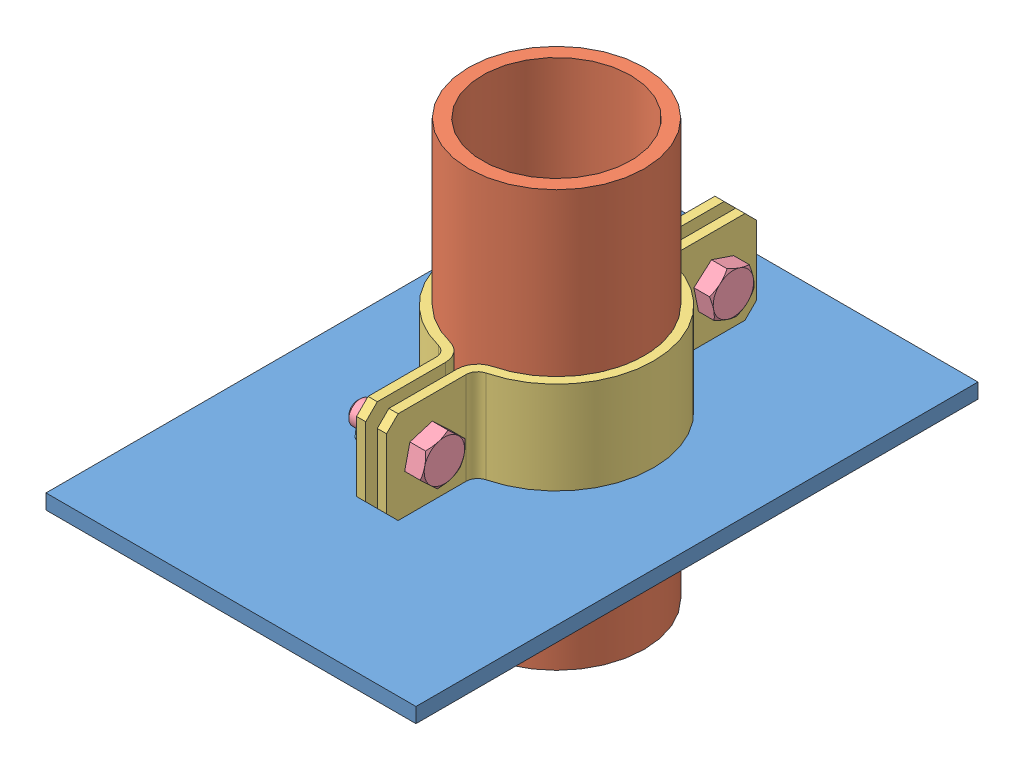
SolidWorks assembly general_tables.SLDASM, configuration Default (file format 3100). Lengths in mm.
Overall size (101.6 114.3 154.35).
8 component instances, 5 part files, 11 mates.
Components (placement in the parent):
- Floor-1: Floor.SLDPRT [Default] at origin size (101.6 4.09 154.35)
- Pipe-1: Pipe.SLDPRT [Default] at origin size (48.26 114.3 48.26)
- Clamp-1: Clamp.SLDPRT [Default] at origin size (25.08 25.4 101.6)
- Clamp-2: Clamp.SLDPRT [Default] x (-1 0 0) z (0 0 1) size (25.08 25.4 101.6)
- Bolt-2: Bolt.SLDPRT [HBOLT 0.2500-20x0.5x0.5-N] at (8.9027 0 39.6875) x (-1 0 0) z (0 0.224236 0.974535) size (23.83 12.85 11.13)
- Bolt-3: Bolt.SLDPRT [HBOLT 0.2500-20x0.5x0.5-N] at (8.9027 0 -39.6875) x (-1 0 0) z (0 -0.751148 -0.660134) size (23.83 12.85 11.13)
- Nut-1: Nut.SLDPRT [HNUT 0.2500-20-D-N] at (-9.8679 0 -39.6875) x (0 -0.928141 -0.37223) z (-1 0 0) size (11.11 12.83 5.74)
- Nut-2: Nut.SLDPRT [HNUT 0.2500-20-D-N] at (-9.8679 0 39.6875) x (0 0.435373 0.90025) z (-1 0 0) size (11.11 12.83 5.74)
Mates (geometry in assembly coordinates):
- Concentric1: concentric anti-aligned: cylinder of Pipe-1; cylinder of Clamp-2
- Coincident1: coincident aligned: plane of Clamp-1 through (1.5875 12.7 -47.625) normal (0 1 0); plane of Clamp-2 through (-1.5875 12.7 -47.625) normal (0 1 0)
- Parallel1: parallel anti-aligned: plane of Clamp-1 through (1.5875 12.7 28.9378) normal (-1 0 0); plane of Clamp-2 through (-1.5875 -12.7 28.9378) normal (1 0 0)
- Coincident3: coincident aligned: circle of ? centre (4.1275 0 39.6875) axis (1 0 0)
- Coincident4: coincident anti-aligned: unknown of ?
- Concentric2: concentric anti-aligned: cylinder of Bolt-2; cylinder of Nut-2
- Coincident5: coincident anti-aligned: plane of Clamp-2 through (-4.1275 -12.7 28.9378) normal (-1 0 0); plane of Nut-2
- Concentric3: concentric aligned: unknown of ?
- Coincident6: coincident anti-aligned: unknown of ?
- Concentric4: concentric anti-aligned: cylinder of Bolt-3; cylinder of Nut-1
- Coincident7: coincident anti-aligned: plane of Clamp-2 through (-4.1275 12.7 -28.9378) normal (-1 0 0); plane of Nut-1
